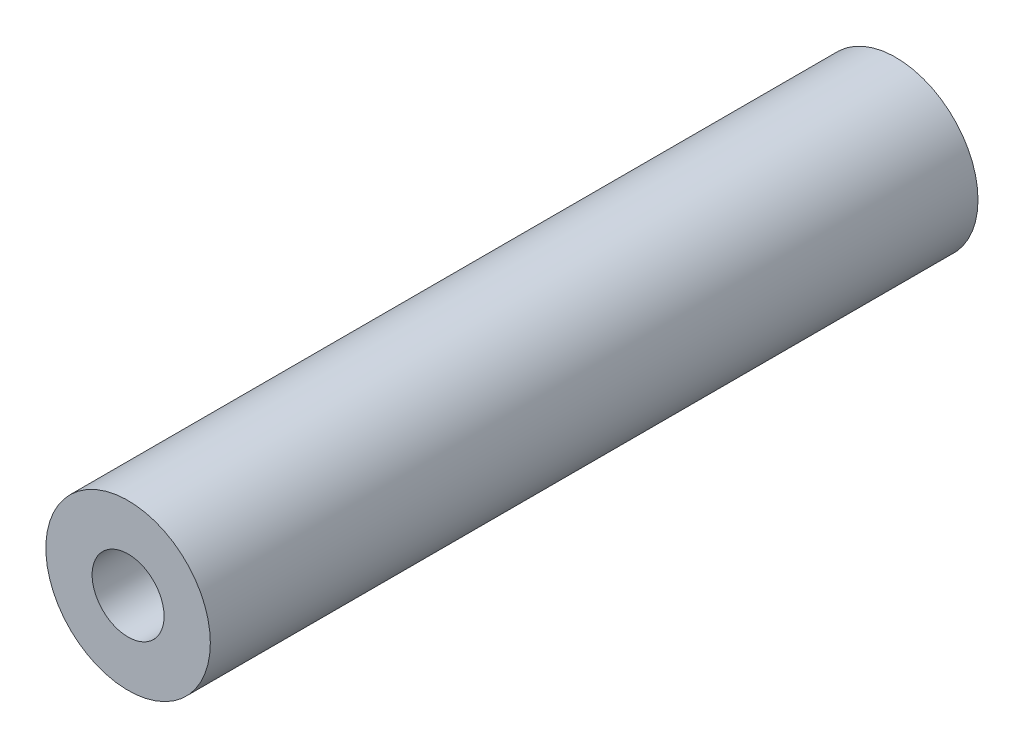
from build123d import *

# Parameters (mm, degrees)
SKETCH1_R                       = 4.7625
SKETCH1_R_2                     = 1.778
EXTRUDE1_DEPTH                  = 22.225
F_8_32_TAPPED_HOLE6_D           = 3.4544
F_8_32_TAPPED_HOLE6_DEPTH       = 16.6624
F_8_32_TAPPED_HOLE6_CBORE_D     = 4.1656
F_8_32_TAPPED_HOLE6_CBORE_DEPTH = 12.7
F_8_32_TAPPED_HOLE6_TIP         = 1.037806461
F_8_32_TAPPED_HOLE7_D           = 3.4544
F_8_32_TAPPED_HOLE7_DEPTH       = 16.6624
F_8_32_TAPPED_HOLE7_CBORE_D     = 4.1656
F_8_32_TAPPED_HOLE7_CBORE_DEPTH = 12.7
F_8_32_TAPPED_HOLE7_TIP         = 1.037806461


with BuildPart() as part:
    # Sketch1 → Extrude1 (new, symmetric)
    with BuildSketch(Plane.XY):
        Circle(SKETCH1_R)
        Circle(SKETCH1_R_2, mode=Mode.SUBTRACT)
    extrude(amount=EXTRUDE1_DEPTH, both=True)

    # 8-32 Tapped Hole6
    with Locations(Plane.XY.offset(22.225)):
        with Locations((0, 0)):
            CounterBoreHole(F_8_32_TAPPED_HOLE6_D / 2, F_8_32_TAPPED_HOLE6_CBORE_D / 2, F_8_32_TAPPED_HOLE6_CBORE_DEPTH, depth=F_8_32_TAPPED_HOLE6_DEPTH)
            with Locations((0, 0, -(F_8_32_TAPPED_HOLE6_DEPTH + F_8_32_TAPPED_HOLE6_TIP / 2))):  # 118° drill point
                Cone(0, F_8_32_TAPPED_HOLE6_D / 2, F_8_32_TAPPED_HOLE6_TIP, mode=Mode.SUBTRACT)

    # 8-32 Tapped Hole7
    with Locations(Plane(origin=(0, 0, -22.225), x_dir=(-1, 0, 0), z_dir=(0, 0, -1))):
        with Locations((0, 0)):
            CounterBoreHole(F_8_32_TAPPED_HOLE7_D / 2, F_8_32_TAPPED_HOLE7_CBORE_D / 2, F_8_32_TAPPED_HOLE7_CBORE_DEPTH, depth=F_8_32_TAPPED_HOLE7_DEPTH)
            with Locations((0, 0, -(F_8_32_TAPPED_HOLE7_DEPTH + F_8_32_TAPPED_HOLE7_TIP / 2))):  # 118° drill point
                Cone(0, F_8_32_TAPPED_HOLE7_D / 2, F_8_32_TAPPED_HOLE7_TIP, mode=Mode.SUBTRACT)


solid = part.part
